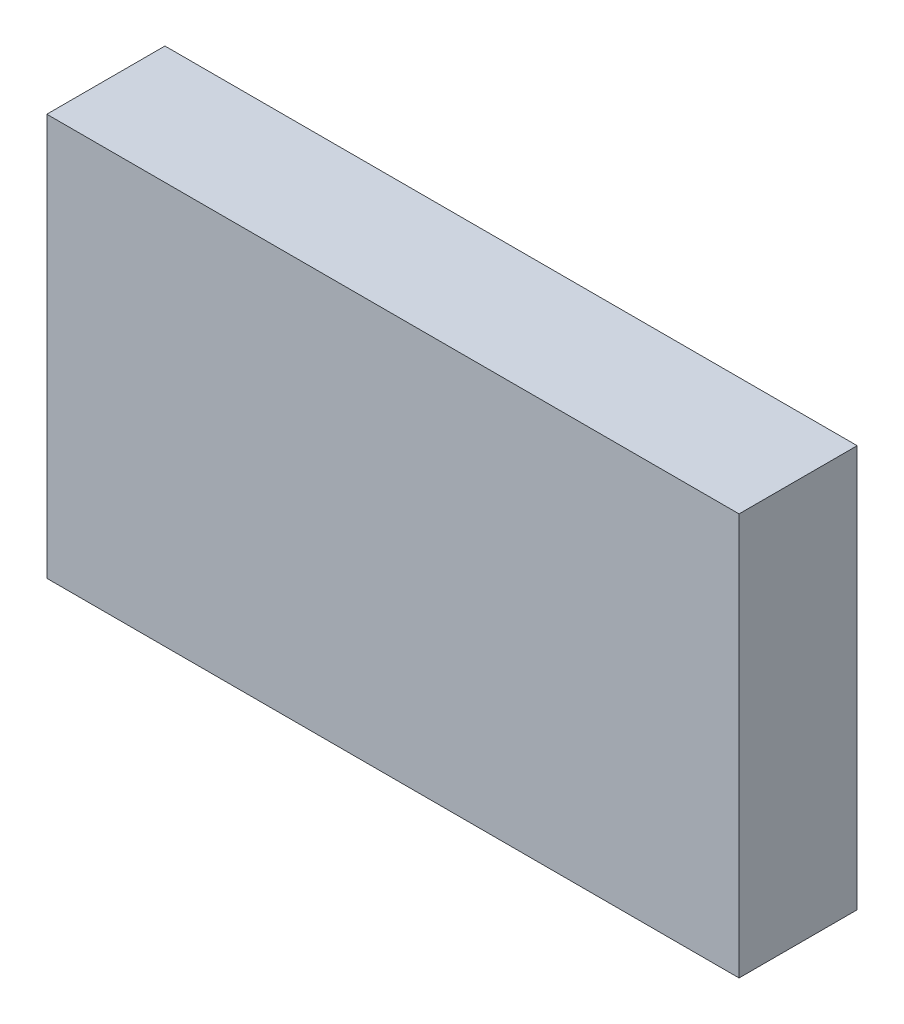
ISO-10303-21;
HEADER;
FILE_DESCRIPTION(('STEP AP214'),'2;1');
FILE_NAME('part.step','',(''),(''),'','','');
FILE_SCHEMA(('AUTOMOTIVE_DESIGN { 1 0 10303 214 1 1 1 1 }'));
ENDSEC;
DATA;
#1=APPLICATION_CONTEXT('core data for automotive mechanical design processes');
#2=APPLICATION_PROTOCOL_DEFINITION('international standard','automotive_design',2000,#1);
#3=PRODUCT_CONTEXT('',#1,'mechanical');
#4=PRODUCT('Part','Part','',(#3));
#5=PRODUCT_RELATED_PRODUCT_CATEGORY('part','',(#4));
#6=PRODUCT_DEFINITION_FORMATION('','',#4);
#7=PRODUCT_DEFINITION_CONTEXT('part definition',#1,'design');
#8=PRODUCT_DEFINITION('design','',#6,#7);
#9=PRODUCT_DEFINITION_SHAPE('','',#8);
#10=(LENGTH_UNIT() NAMED_UNIT(*) SI_UNIT(.MILLI.,.METRE.));
#11=(NAMED_UNIT(*) PLANE_ANGLE_UNIT() SI_UNIT($,.RADIAN.));
#12=(NAMED_UNIT(*) SI_UNIT($,.STERADIAN.) SOLID_ANGLE_UNIT());
#13=UNCERTAINTY_MEASURE_WITH_UNIT(LENGTH_MEASURE(1.E-05),#10,'distance_accuracy_value','');
#14=(GEOMETRIC_REPRESENTATION_CONTEXT(3) GLOBAL_UNCERTAINTY_ASSIGNED_CONTEXT((#13)) GLOBAL_UNIT_ASSIGNED_CONTEXT((#10,
#11,#12)) REPRESENTATION_CONTEXT('',''));
#15=CARTESIAN_POINT('',(0.,0.,0.));
#16=DIRECTION('',(0.,0.,1.));
#17=DIRECTION('',(1.,0.,0.));
#18=AXIS2_PLACEMENT_3D('',#15,#16,#17);
#19=CARTESIAN_POINT('',(-7.7597,4.43850499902,2.54));
#20=DIRECTION('',(1.,0.,0.));
#21=DIRECTION('',(0.,0.,-1.));
#22=AXIS2_PLACEMENT_3D('',#19,#20,#21);
#23=PLANE('',#22);
#24=DIRECTION('',(0.,-1.,0.));
#25=VECTOR('',#24,1.);
#26=CARTESIAN_POINT('',(-7.7597,4.43850499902,0.));
#27=LINE('',#26,#25);
#28=CARTESIAN_POINT('',(-7.7597,4.43850499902,0.));
#29=VERTEX_POINT('',#28);
#30=CARTESIAN_POINT('',(-7.7597,-4.2037,0.));
#31=VERTEX_POINT('',#30);
#32=EDGE_CURVE('E96',#29,#31,#27,.T.);
#33=ORIENTED_EDGE('',*,*,#32,.T.);
#34=DIRECTION('',(0.,0.,-1.));
#35=VECTOR('',#34,1.);
#36=CARTESIAN_POINT('',(-7.7597,-4.2037,2.54));
#37=LINE('',#36,#35);
#38=CARTESIAN_POINT('',(-7.7597,-4.2037,2.54));
#39=VERTEX_POINT('',#38);
#40=EDGE_CURVE('E11',#39,#31,#37,.T.);
#41=ORIENTED_EDGE('',*,*,#40,.F.);
#42=DIRECTION('',(0.,-1.,0.));
#43=VECTOR('',#42,1.);
#44=CARTESIAN_POINT('',(-7.7597,4.43850499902,2.54));
#45=LINE('',#44,#43);
#46=CARTESIAN_POINT('',(-7.7597,4.43850499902,2.54));
#47=VERTEX_POINT('',#46);
#48=EDGE_CURVE('E84',#47,#39,#45,.T.);
#49=ORIENTED_EDGE('',*,*,#48,.F.);
#50=DIRECTION('',(0.,0.,-1.));
#51=VECTOR('',#50,1.);
#52=CARTESIAN_POINT('',(-7.7597,4.43850499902,2.54));
#53=LINE('',#52,#51);
#54=EDGE_CURVE('E92',#47,#29,#53,.T.);
#55=ORIENTED_EDGE('',*,*,#54,.T.);
#56=EDGE_LOOP('',(#33,#41,#49,#55));
#57=FACE_BOUND('',#56,.T.);
#58=ADVANCED_FACE('F33',(#57),#23,.F.);
#59=CARTESIAN_POINT('',(-7.7597,-4.2037,2.54));
#60=DIRECTION('',(0.,1.,0.));
#61=DIRECTION('',(0.,0.,1.));
#62=AXIS2_PLACEMENT_3D('',#59,#60,#61);
#63=PLANE('',#62);
#64=DIRECTION('',(1.,0.,0.));
#65=VECTOR('',#64,1.);
#66=CARTESIAN_POINT('',(-7.7597,-4.2037,0.));
#67=LINE('',#66,#65);
#68=CARTESIAN_POINT('',(7.1247,-4.2037,0.));
#69=VERTEX_POINT('',#68);
#70=EDGE_CURVE('E88',#31,#69,#67,.T.);
#71=ORIENTED_EDGE('',*,*,#70,.T.);
#72=DIRECTION('',(0.,0.,-1.));
#73=VECTOR('',#72,1.);
#74=CARTESIAN_POINT('',(7.1247,-4.2037,2.54));
#75=LINE('',#74,#73);
#76=CARTESIAN_POINT('',(7.1247,-4.2037,2.54));
#77=VERTEX_POINT('',#76);
#78=EDGE_CURVE('E41',#77,#69,#75,.T.);
#79=ORIENTED_EDGE('',*,*,#78,.F.);
#80=DIRECTION('',(1.,0.,0.));
#81=VECTOR('',#80,1.);
#82=CARTESIAN_POINT('',(-7.7597,-4.2037,2.54));
#83=LINE('',#82,#81);
#84=EDGE_CURVE('E79',#39,#77,#83,.T.);
#85=ORIENTED_EDGE('',*,*,#84,.F.);
#86=ORIENTED_EDGE('',*,*,#40,.T.);
#87=EDGE_LOOP('',(#71,#79,#85,#86));
#88=FACE_BOUND('',#87,.T.);
#89=ADVANCED_FACE('F87',(#88),#63,.F.);
#90=CARTESIAN_POINT('',(7.1247,-4.2037,2.54));
#91=DIRECTION('',(-1.,0.,0.));
#92=DIRECTION('',(0.,0.,1.));
#93=AXIS2_PLACEMENT_3D('',#90,#91,#92);
#94=PLANE('',#93);
#95=DIRECTION('',(0.,1.,0.));
#96=VECTOR('',#95,1.);
#97=CARTESIAN_POINT('',(7.1247,-4.2037,0.));
#98=LINE('',#97,#96);
#99=CARTESIAN_POINT('',(7.1247,4.43850499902,0.));
#100=VERTEX_POINT('',#99);
#101=EDGE_CURVE('E66',#69,#100,#98,.T.);
#102=ORIENTED_EDGE('',*,*,#101,.T.);
#103=DIRECTION('',(0.,0.,-1.));
#104=VECTOR('',#103,1.);
#105=CARTESIAN_POINT('',(7.1247,4.43850499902,2.54));
#106=LINE('',#105,#104);
#107=CARTESIAN_POINT('',(7.1247,4.43850499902,2.54));
#108=VERTEX_POINT('',#107);
#109=EDGE_CURVE('E89',#108,#100,#106,.T.);
#110=ORIENTED_EDGE('',*,*,#109,.F.);
#111=DIRECTION('',(0.,1.,0.));
#112=VECTOR('',#111,1.);
#113=CARTESIAN_POINT('',(7.1247,-4.2037,2.54));
#114=LINE('',#113,#112);
#115=EDGE_CURVE('E82',#77,#108,#114,.T.);
#116=ORIENTED_EDGE('',*,*,#115,.F.);
#117=ORIENTED_EDGE('',*,*,#78,.T.);
#118=EDGE_LOOP('',(#102,#110,#116,#117));
#119=FACE_BOUND('',#118,.T.);
#120=ADVANCED_FACE('F90',(#119),#94,.F.);
#121=CARTESIAN_POINT('',(7.1247,4.43850499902,2.54));
#122=DIRECTION('',(0.,-1.,0.));
#123=DIRECTION('',(0.,0.,-1.));
#124=AXIS2_PLACEMENT_3D('',#121,#122,#123);
#125=PLANE('',#124);
#126=DIRECTION('',(-1.,0.,0.));
#127=VECTOR('',#126,1.);
#128=CARTESIAN_POINT('',(7.1247,4.43850499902,0.));
#129=LINE('',#128,#127);
#130=EDGE_CURVE('E72',#100,#29,#129,.T.);
#131=ORIENTED_EDGE('',*,*,#130,.T.);
#132=ORIENTED_EDGE('',*,*,#54,.F.);
#133=DIRECTION('',(-1.,0.,0.));
#134=VECTOR('',#133,1.);
#135=CARTESIAN_POINT('',(7.1247,4.43850499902,2.54));
#136=LINE('',#135,#134);
#137=EDGE_CURVE('E49',#108,#47,#136,.T.);
#138=ORIENTED_EDGE('',*,*,#137,.F.);
#139=ORIENTED_EDGE('',*,*,#109,.T.);
#140=EDGE_LOOP('',(#131,#132,#138,#139));
#141=FACE_BOUND('',#140,.T.);
#142=ADVANCED_FACE('F103',(#141),#125,.F.);
#143=CARTESIAN_POINT('',(0.,0.,2.54));
#144=DIRECTION('',(0.,0.,1.));
#145=DIRECTION('',(1.,0.,0.));
#146=AXIS2_PLACEMENT_3D('',#143,#144,#145);
#147=PLANE('',#146);
#148=ORIENTED_EDGE('',*,*,#48,.T.);
#149=ORIENTED_EDGE('',*,*,#84,.T.);
#150=ORIENTED_EDGE('',*,*,#115,.T.);
#151=ORIENTED_EDGE('',*,*,#137,.T.);
#152=EDGE_LOOP('',(#148,#149,#150,#151));
#153=FACE_BOUND('',#152,.T.);
#154=ADVANCED_FACE('F80',(#153),#147,.T.);
#155=CARTESIAN_POINT('',(0.,0.,0.));
#156=DIRECTION('',(0.,0.,1.));
#157=DIRECTION('',(1.,0.,0.));
#158=AXIS2_PLACEMENT_3D('',#155,#156,#157);
#159=PLANE('',#158);
#160=ORIENTED_EDGE('',*,*,#32,.F.);
#161=ORIENTED_EDGE('',*,*,#130,.F.);
#162=ORIENTED_EDGE('',*,*,#101,.F.);
#163=ORIENTED_EDGE('',*,*,#70,.F.);
#164=EDGE_LOOP('',(#160,#161,#162,#163));
#165=FACE_BOUND('',#164,.T.);
#166=ADVANCED_FACE('F106',(#165),#159,.F.);
#167=CLOSED_SHELL('',(#58,#89,#120,#142,#154,#166));
#168=MANIFOLD_SOLID_BREP('B2',#167);
#169=ADVANCED_BREP_SHAPE_REPRESENTATION('',(#18,#168),#14);
#170=SHAPE_DEFINITION_REPRESENTATION(#9,#169);
ENDSEC;
END-ISO-10303-21;
